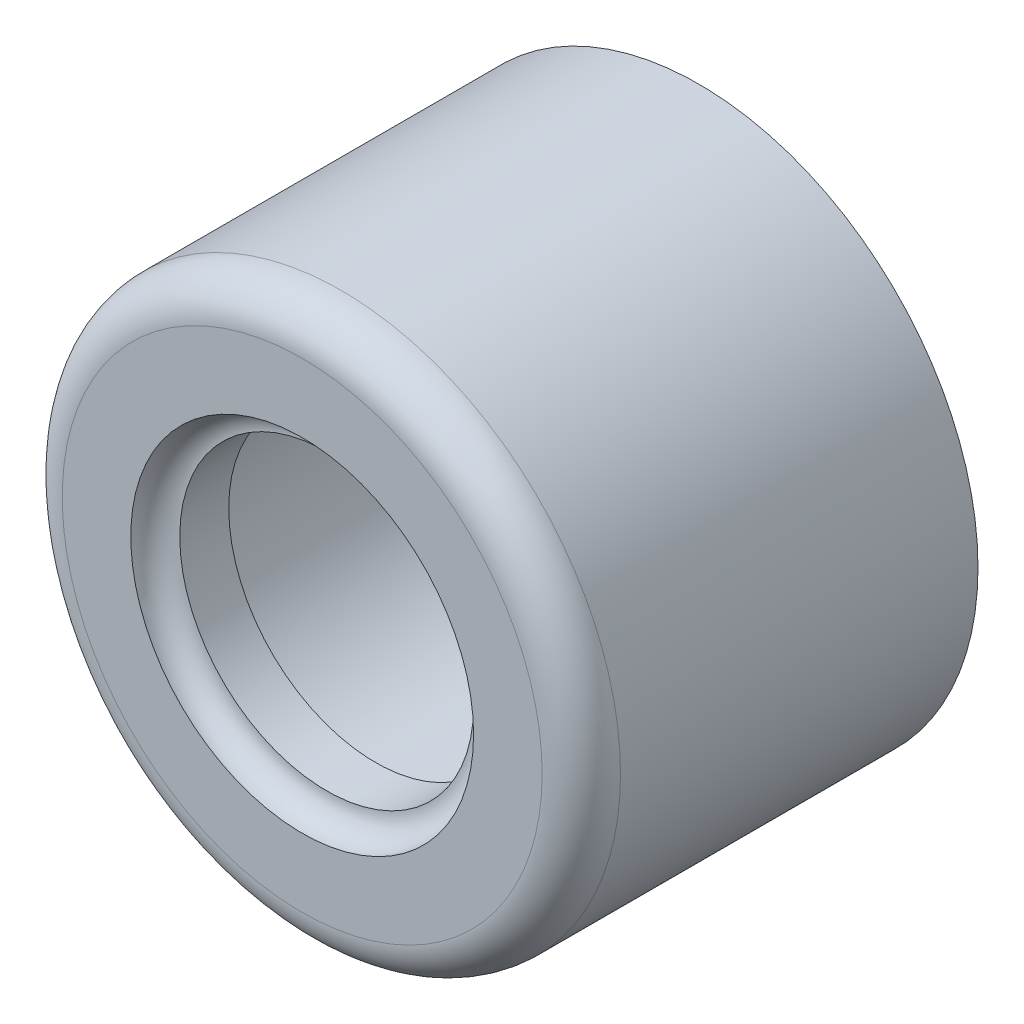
ISO-10303-21;
HEADER;
FILE_DESCRIPTION(('STEP AP214'),'2;1');
FILE_NAME('part.step','',(''),(''),'','','');
FILE_SCHEMA(('AUTOMOTIVE_DESIGN { 1 0 10303 214 1 1 1 1 }'));
ENDSEC;
DATA;
#1=APPLICATION_CONTEXT('core data for automotive mechanical design processes');
#2=APPLICATION_PROTOCOL_DEFINITION('international standard','automotive_design',2000,#1);
#3=PRODUCT_CONTEXT('',#1,'mechanical');
#4=PRODUCT('Part','Part','',(#3));
#5=PRODUCT_RELATED_PRODUCT_CATEGORY('part','',(#4));
#6=PRODUCT_DEFINITION_FORMATION('','',#4);
#7=PRODUCT_DEFINITION_CONTEXT('part definition',#1,'design');
#8=PRODUCT_DEFINITION('design','',#6,#7);
#9=PRODUCT_DEFINITION_SHAPE('','',#8);
#10=(LENGTH_UNIT() NAMED_UNIT(*) SI_UNIT(.MILLI.,.METRE.));
#11=(NAMED_UNIT(*) PLANE_ANGLE_UNIT() SI_UNIT($,.RADIAN.));
#12=(NAMED_UNIT(*) SI_UNIT($,.STERADIAN.) SOLID_ANGLE_UNIT());
#13=UNCERTAINTY_MEASURE_WITH_UNIT(LENGTH_MEASURE(1.E-05),#10,'distance_accuracy_value','');
#14=(GEOMETRIC_REPRESENTATION_CONTEXT(3) GLOBAL_UNCERTAINTY_ASSIGNED_CONTEXT((#13)) GLOBAL_UNIT_ASSIGNED_CONTEXT((#10,
#11,#12)) REPRESENTATION_CONTEXT('',''));
#15=CARTESIAN_POINT('',(0.,0.,0.));
#16=DIRECTION('',(0.,0.,1.));
#17=DIRECTION('',(1.,0.,0.));
#18=AXIS2_PLACEMENT_3D('',#15,#16,#17);
#19=CARTESIAN_POINT('',(0.,0.,40.5));
#20=DIRECTION('',(0.,0.,-1.));
#21=DIRECTION('',(-1.,0.,0.));
#22=AXIS2_PLACEMENT_3D('',#19,#20,#21);
#23=CYLINDRICAL_SURFACE('',#22,15.);
#24=CARTESIAN_POINT('',(0.,0.,38.));
#25=DIRECTION('',(0.,0.,1.));
#26=DIRECTION('',(1.,0.,0.));
#27=AXIS2_PLACEMENT_3D('',#24,#25,#26);
#28=CIRCLE('',#27,15.);
#29=CARTESIAN_POINT('',(15.,0.,38.));
#30=VERTEX_POINT('',#29);
#31=EDGE_CURVE('E76',#30,#30,#28,.F.);
#32=ORIENTED_EDGE('',*,*,#31,.F.);
#33=EDGE_LOOP('',(#32));
#34=FACE_BOUND('',#33,.T.);
#35=CARTESIAN_POINT('',(0.,0.,33.));
#36=DIRECTION('',(0.,0.,-1.));
#37=DIRECTION('',(-1.,0.,0.));
#38=AXIS2_PLACEMENT_3D('',#35,#36,#37);
#39=CIRCLE('',#38,15.);
#40=CARTESIAN_POINT('',(-15.,0.,33.));
#41=VERTEX_POINT('',#40);
#42=EDGE_CURVE('E47',#41,#41,#39,.F.);
#43=ORIENTED_EDGE('',*,*,#42,.F.);
#44=EDGE_LOOP('',(#43));
#45=FACE_BOUND('',#44,.T.);
#46=ADVANCED_FACE('F43',(#34,#45),#23,.F.);
#47=CARTESIAN_POINT('',(0.,0.,40.5));
#48=DIRECTION('',(0.,0.,-1.));
#49=DIRECTION('',(-1.,0.,0.));
#50=AXIS2_PLACEMENT_3D('',#47,#48,#49);
#51=CYLINDRICAL_SURFACE('',#50,28.5);
#52=CARTESIAN_POINT('',(0.,0.,36.5));
#53=DIRECTION('',(0.,0.,1.));
#54=DIRECTION('',(1.,0.,0.));
#55=AXIS2_PLACEMENT_3D('',#52,#53,#54);
#56=CIRCLE('',#55,28.5);
#57=CARTESIAN_POINT('',(28.5,0.,36.5));
#58=VERTEX_POINT('',#57);
#59=EDGE_CURVE('E13',#58,#58,#56,.F.);
#60=ORIENTED_EDGE('',*,*,#59,.T.);
#61=EDGE_LOOP('',(#60));
#62=FACE_BOUND('',#61,.T.);
#63=CARTESIAN_POINT('',(0.,0.,0.));
#64=DIRECTION('',(0.,0.,1.));
#65=DIRECTION('',(1.,0.,0.));
#66=AXIS2_PLACEMENT_3D('',#63,#64,#65);
#67=CIRCLE('',#66,28.5);
#68=CARTESIAN_POINT('',(28.5,0.,0.));
#69=VERTEX_POINT('',#68);
#70=EDGE_CURVE('E105',#69,#69,#67,.T.);
#71=ORIENTED_EDGE('',*,*,#70,.T.);
#72=EDGE_LOOP('',(#71));
#73=FACE_BOUND('',#72,.T.);
#74=ADVANCED_FACE('F45',(#62,#73),#51,.T.);
#75=CARTESIAN_POINT('',(0.,0.,40.5));
#76=DIRECTION('',(0.,0.,1.));
#77=DIRECTION('',(1.,0.,0.));
#78=AXIS2_PLACEMENT_3D('',#75,#76,#77);
#79=PLANE('',#78);
#80=CARTESIAN_POINT('',(0.,0.,40.5));
#81=DIRECTION('',(0.,0.,1.));
#82=DIRECTION('',(1.,0.,0.));
#83=AXIS2_PLACEMENT_3D('',#80,#81,#82);
#84=CIRCLE('',#83,17.5);
#85=CARTESIAN_POINT('',(17.5,0.,40.5));
#86=VERTEX_POINT('',#85);
#87=EDGE_CURVE('E102',#86,#86,#84,.T.);
#88=ORIENTED_EDGE('',*,*,#87,.F.);
#89=EDGE_LOOP('',(#88));
#90=FACE_BOUND('',#89,.T.);
#91=CARTESIAN_POINT('',(0.,0.,40.5));
#92=DIRECTION('',(0.,0.,1.));
#93=DIRECTION('',(1.,0.,0.));
#94=AXIS2_PLACEMENT_3D('',#91,#92,#93);
#95=CIRCLE('',#94,24.5);
#96=CARTESIAN_POINT('',(24.5,0.,40.5));
#97=VERTEX_POINT('',#96);
#98=EDGE_CURVE('E52',#97,#97,#95,.T.);
#99=ORIENTED_EDGE('',*,*,#98,.T.);
#100=EDGE_LOOP('',(#99));
#101=FACE_BOUND('',#100,.T.);
#102=ADVANCED_FACE('F111',(#90,#101),#79,.T.);
#103=CARTESIAN_POINT('',(0.,0.,0.));
#104=DIRECTION('',(0.,0.,1.));
#105=DIRECTION('',(1.,0.,0.));
#106=AXIS2_PLACEMENT_3D('',#103,#104,#105);
#107=PLANE('',#106);
#108=CARTESIAN_POINT('',(0.,0.,0.));
#109=DIRECTION('',(0.,0.,-1.));
#110=DIRECTION('',(-1.,0.,0.));
#111=AXIS2_PLACEMENT_3D('',#108,#109,#110);
#112=CIRCLE('',#111,17.5);
#113=CARTESIAN_POINT('',(-17.5,0.,0.));
#114=VERTEX_POINT('',#113);
#115=EDGE_CURVE('E224',#114,#114,#112,.T.);
#116=ORIENTED_EDGE('',*,*,#115,.F.);
#117=EDGE_LOOP('',(#116));
#118=FACE_BOUND('',#117,.T.);
#119=CARTESIAN_POINT('',(-23.,1.60608234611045E-13,0.));
#120=DIRECTION('',(0.,0.,-1.));
#121=DIRECTION('',(-1.,0.,0.));
#122=AXIS2_PLACEMENT_3D('',#119,#120,#121);
#123=CIRCLE('',#122,2.5);
#124=CARTESIAN_POINT('',(-25.5,1.60608234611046E-13,0.));
#125=VERTEX_POINT('',#124);
#126=EDGE_CURVE('E75',#125,#125,#123,.T.);
#127=ORIENTED_EDGE('',*,*,#126,.F.);
#128=EDGE_LOOP('',(#127));
#129=FACE_BOUND('',#128,.T.);
#130=CARTESIAN_POINT('',(-1.60608234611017E-13,-23.,0.));
#131=DIRECTION('',(0.,0.,-1.));
#132=DIRECTION('',(-1.,0.,0.));
#133=AXIS2_PLACEMENT_3D('',#130,#131,#132);
#134=CIRCLE('',#133,3.);
#135=CARTESIAN_POINT('',(-3.00000000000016,-23.,0.));
#136=VERTEX_POINT('',#135);
#137=EDGE_CURVE('E79',#136,#136,#134,.T.);
#138=ORIENTED_EDGE('',*,*,#137,.F.);
#139=EDGE_LOOP('',(#138));
#140=FACE_BOUND('',#139,.T.);
#141=CARTESIAN_POINT('',(23.,0.,0.));
#142=DIRECTION('',(0.,0.,-1.));
#143=DIRECTION('',(-1.,0.,0.));
#144=AXIS2_PLACEMENT_3D('',#141,#142,#143);
#145=CIRCLE('',#144,2.5);
#146=CARTESIAN_POINT('',(20.5,0.,0.));
#147=VERTEX_POINT('',#146);
#148=EDGE_CURVE('E93',#147,#147,#145,.T.);
#149=ORIENTED_EDGE('',*,*,#148,.F.);
#150=EDGE_LOOP('',(#149));
#151=FACE_BOUND('',#150,.T.);
#152=CARTESIAN_POINT('',(0.,23.,0.));
#153=DIRECTION('',(0.,0.,-1.));
#154=DIRECTION('',(-1.,0.,0.));
#155=AXIS2_PLACEMENT_3D('',#152,#153,#154);
#156=CIRCLE('',#155,3.);
#157=CARTESIAN_POINT('',(-3.,23.,0.));
#158=VERTEX_POINT('',#157);
#159=EDGE_CURVE('E96',#158,#158,#156,.T.);
#160=ORIENTED_EDGE('',*,*,#159,.F.);
#161=EDGE_LOOP('',(#160));
#162=FACE_BOUND('',#161,.T.);
#163=ORIENTED_EDGE('',*,*,#70,.F.);
#164=EDGE_LOOP('',(#163));
#165=FACE_BOUND('',#164,.T.);
#166=ADVANCED_FACE('F116',(#118,#129,#140,#151,#162,#165),#107,.F.);
#167=CARTESIAN_POINT('',(0.,0.,36.5));
#168=DIRECTION('',(0.,0.,1.));
#169=DIRECTION('',(1.,0.,0.));
#170=AXIS2_PLACEMENT_3D('',#167,#168,#169);
#171=TOROIDAL_SURFACE('',#170,24.5,4.);
#172=ORIENTED_EDGE('',*,*,#59,.F.);
#173=EDGE_LOOP('',(#172));
#174=FACE_BOUND('',#173,.T.);
#175=ORIENTED_EDGE('',*,*,#98,.F.);
#176=EDGE_LOOP('',(#175));
#177=FACE_BOUND('',#176,.T.);
#178=ADVANCED_FACE('F113',(#174,#177),#171,.T.);
#179=CARTESIAN_POINT('',(0.,0.,40.5));
#180=DIRECTION('',(0.,0.,1.));
#181=DIRECTION('',(1.,0.,0.));
#182=AXIS2_PLACEMENT_3D('',#179,#180,#181);
#183=TOROIDAL_SURFACE('',#182,15.,2.5);
#184=ORIENTED_EDGE('',*,*,#87,.T.);
#185=EDGE_LOOP('',(#184));
#186=FACE_BOUND('',#185,.T.);
#187=ORIENTED_EDGE('',*,*,#31,.T.);
#188=EDGE_LOOP('',(#187));
#189=FACE_BOUND('',#188,.T.);
#190=ADVANCED_FACE('F115',(#186,#189),#183,.F.);
#191=CARTESIAN_POINT('',(0.,23.,20.));
#192=DIRECTION('',(0.,0.,-1.));
#193=DIRECTION('',(-1.,0.,0.));
#194=AXIS2_PLACEMENT_3D('',#191,#192,#193);
#195=CONICAL_SURFACE('',#194,3.,1.02974425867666);
#196=CARTESIAN_POINT('',(0.,23.,21.8025818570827));
#197=VERTEX_POINT('',#196);
#198=VERTEX_LOOP('',#197);
#199=FACE_BOUND('',#198,.T.);
#200=CARTESIAN_POINT('',(0.,23.,20.));
#201=DIRECTION('',(0.,0.,-1.));
#202=DIRECTION('',(-1.,0.,0.));
#203=AXIS2_PLACEMENT_3D('',#200,#201,#202);
#204=CIRCLE('',#203,3.);
#205=CARTESIAN_POINT('',(-3.,23.,20.));
#206=VERTEX_POINT('',#205);
#207=EDGE_CURVE('E99',#206,#206,#204,.T.);
#208=ORIENTED_EDGE('',*,*,#207,.T.);
#209=EDGE_LOOP('',(#208));
#210=FACE_BOUND('',#209,.T.);
#211=ADVANCED_FACE('F123',(#199,#210),#195,.F.);
#212=CARTESIAN_POINT('',(0.,23.,0.));
#213=DIRECTION('',(0.,0.,-1.));
#214=DIRECTION('',(-1.,0.,0.));
#215=AXIS2_PLACEMENT_3D('',#212,#213,#214);
#216=CYLINDRICAL_SURFACE('',#215,3.);
#217=ORIENTED_EDGE('',*,*,#207,.F.);
#218=EDGE_LOOP('',(#217));
#219=FACE_BOUND('',#218,.T.);
#220=ORIENTED_EDGE('',*,*,#159,.T.);
#221=EDGE_LOOP('',(#220));
#222=FACE_BOUND('',#221,.T.);
#223=ADVANCED_FACE('F158',(#219,#222),#216,.F.);
#224=CARTESIAN_POINT('',(23.,0.,0.));
#225=DIRECTION('',(0.,0.,-1.));
#226=DIRECTION('',(-1.,0.,0.));
#227=AXIS2_PLACEMENT_3D('',#224,#225,#226);
#228=CYLINDRICAL_SURFACE('',#227,2.5);
#229=CARTESIAN_POINT('',(23.,0.,20.));
#230=DIRECTION('',(0.,0.,-1.));
#231=DIRECTION('',(-1.,0.,0.));
#232=AXIS2_PLACEMENT_3D('',#229,#230,#231);
#233=CIRCLE('',#232,2.5);
#234=CARTESIAN_POINT('',(20.5,0.,20.));
#235=VERTEX_POINT('',#234);
#236=EDGE_CURVE('E90',#235,#235,#233,.T.);
#237=ORIENTED_EDGE('',*,*,#236,.F.);
#238=EDGE_LOOP('',(#237));
#239=FACE_BOUND('',#238,.T.);
#240=ORIENTED_EDGE('',*,*,#148,.T.);
#241=EDGE_LOOP('',(#240));
#242=FACE_BOUND('',#241,.T.);
#243=ADVANCED_FACE('F155',(#239,#242),#228,.F.);
#244=CARTESIAN_POINT('',(23.,0.,20.));
#245=DIRECTION('',(0.,0.,-1.));
#246=DIRECTION('',(-1.,0.,0.));
#247=AXIS2_PLACEMENT_3D('',#244,#245,#246);
#248=CONICAL_SURFACE('',#247,2.5,1.02974425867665);
#249=CARTESIAN_POINT('',(23.,0.,21.5021515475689));
#250=VERTEX_POINT('',#249);
#251=VERTEX_LOOP('',#250);
#252=FACE_BOUND('',#251,.T.);
#253=ORIENTED_EDGE('',*,*,#236,.T.);
#254=EDGE_LOOP('',(#253));
#255=FACE_BOUND('',#254,.T.);
#256=ADVANCED_FACE('F151',(#252,#255),#248,.F.);
#257=CARTESIAN_POINT('',(-1.61448966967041E-13,-23.,19.9999999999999));
#258=DIRECTION('',(0.,0.,-1.));
#259=DIRECTION('',(-1.,0.,0.));
#260=AXIS2_PLACEMENT_3D('',#257,#258,#259);
#261=CONICAL_SURFACE('',#260,3.,1.02974425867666);
#262=CARTESIAN_POINT('',(-1.61524741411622E-13,-23.,21.8025818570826));
#263=VERTEX_POINT('',#262);
#264=VERTEX_LOOP('',#263);
#265=FACE_BOUND('',#264,.T.);
#266=CARTESIAN_POINT('',(-1.61448966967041E-13,-23.,19.9999999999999));
#267=DIRECTION('',(0.,0.,-1.));
#268=DIRECTION('',(-1.,0.,0.));
#269=AXIS2_PLACEMENT_3D('',#266,#267,#268);
#270=CIRCLE('',#269,3.);
#271=CARTESIAN_POINT('',(-3.00000000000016,-23.,19.9999999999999));
#272=VERTEX_POINT('',#271);
#273=EDGE_CURVE('E87',#272,#272,#270,.T.);
#274=ORIENTED_EDGE('',*,*,#273,.T.);
#275=EDGE_LOOP('',(#274));
#276=FACE_BOUND('',#275,.T.);
#277=ADVANCED_FACE('F147',(#265,#276),#261,.F.);
#278=CARTESIAN_POINT('',(-1.60608234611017E-13,-23.,0.));
#279=DIRECTION('',(0.,0.,-1.));
#280=DIRECTION('',(-1.,0.,0.));
#281=AXIS2_PLACEMENT_3D('',#278,#279,#280);
#282=CYLINDRICAL_SURFACE('',#281,3.);
#283=ORIENTED_EDGE('',*,*,#273,.F.);
#284=EDGE_LOOP('',(#283));
#285=FACE_BOUND('',#284,.T.);
#286=ORIENTED_EDGE('',*,*,#137,.T.);
#287=EDGE_LOOP('',(#286));
#288=FACE_BOUND('',#287,.T.);
#289=ADVANCED_FACE('F144',(#285,#288),#282,.F.);
#290=CARTESIAN_POINT('',(-23.,1.60608234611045E-13,0.));
#291=DIRECTION('',(0.,0.,-1.));
#292=DIRECTION('',(-1.,0.,0.));
#293=AXIS2_PLACEMENT_3D('',#290,#291,#292);
#294=CYLINDRICAL_SURFACE('',#293,2.5);
#295=CARTESIAN_POINT('',(-23.,1.65590333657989E-13,20.));
#296=DIRECTION('',(0.,0.,-1.));
#297=DIRECTION('',(-1.,0.,0.));
#298=AXIS2_PLACEMENT_3D('',#295,#296,#297);
#299=CIRCLE('',#298,2.5);
#300=CARTESIAN_POINT('',(-25.5,1.65590333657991E-13,20.));
#301=VERTEX_POINT('',#300);
#302=EDGE_CURVE('E73',#301,#301,#299,.T.);
#303=ORIENTED_EDGE('',*,*,#302,.F.);
#304=EDGE_LOOP('',(#303));
#305=FACE_BOUND('',#304,.T.);
#306=ORIENTED_EDGE('',*,*,#126,.T.);
#307=EDGE_LOOP('',(#306));
#308=FACE_BOUND('',#307,.T.);
#309=ADVANCED_FACE('F69',(#305,#308),#294,.F.);
#310=CARTESIAN_POINT('',(-23.,1.65590333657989E-13,20.));
#311=DIRECTION('',(0.,0.,-1.));
#312=DIRECTION('',(-1.,0.,0.));
#313=AXIS2_PLACEMENT_3D('',#310,#311,#312);
#314=CONICAL_SURFACE('',#313,2.5,1.02974425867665);
#315=CARTESIAN_POINT('',(-23.,1.65964527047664E-13,21.5021515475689));
#316=VERTEX_POINT('',#315);
#317=VERTEX_LOOP('',#316);
#318=FACE_BOUND('',#317,.T.);
#319=ORIENTED_EDGE('',*,*,#302,.T.);
#320=EDGE_LOOP('',(#319));
#321=FACE_BOUND('',#320,.T.);
#322=ADVANCED_FACE('F65',(#318,#321),#314,.F.);
#323=CARTESIAN_POINT('',(0.,0.,33.));
#324=DIRECTION('',(0.,0.,-1.));
#325=DIRECTION('',(-1.,0.,0.));
#326=AXIS2_PLACEMENT_3D('',#323,#324,#325);
#327=PLANE('',#326);
#328=CARTESIAN_POINT('',(0.,0.,33.));
#329=DIRECTION('',(0.,0.,-1.));
#330=DIRECTION('',(-1.,0.,0.));
#331=AXIS2_PLACEMENT_3D('',#328,#329,#330);
#332=CIRCLE('',#331,17.5);
#333=CARTESIAN_POINT('',(-17.5,0.,33.));
#334=VERTEX_POINT('',#333);
#335=EDGE_CURVE('E221',#334,#334,#332,.T.);
#336=ORIENTED_EDGE('',*,*,#335,.T.);
#337=EDGE_LOOP('',(#336));
#338=FACE_BOUND('',#337,.T.);
#339=ORIENTED_EDGE('',*,*,#42,.T.);
#340=EDGE_LOOP('',(#339));
#341=FACE_BOUND('',#340,.T.);
#342=ADVANCED_FACE('F68',(#338,#341),#327,.T.);
#343=CARTESIAN_POINT('',(0.,0.,33.));
#344=DIRECTION('',(0.,0.,-1.));
#345=DIRECTION('',(-1.,0.,0.));
#346=AXIS2_PLACEMENT_3D('',#343,#344,#345);
#347=CYLINDRICAL_SURFACE('',#346,17.5);
#348=ORIENTED_EDGE('',*,*,#335,.F.);
#349=EDGE_LOOP('',(#348));
#350=FACE_BOUND('',#349,.T.);
#351=ORIENTED_EDGE('',*,*,#115,.T.);
#352=EDGE_LOOP('',(#351));
#353=FACE_BOUND('',#352,.T.);
#354=ADVANCED_FACE('F139',(#350,#353),#347,.F.);
#355=CLOSED_SHELL('',(#46,#74,#102,#166,#178,#190,#211,#223,#243,#256,#277,#289,#309,#322,#342,#354));
#356=MANIFOLD_SOLID_BREP('B2',#355);
#357=ADVANCED_BREP_SHAPE_REPRESENTATION('',(#18,#356),#14);
#358=SHAPE_DEFINITION_REPRESENTATION(#9,#357);
ENDSEC;
END-ISO-10303-21;
